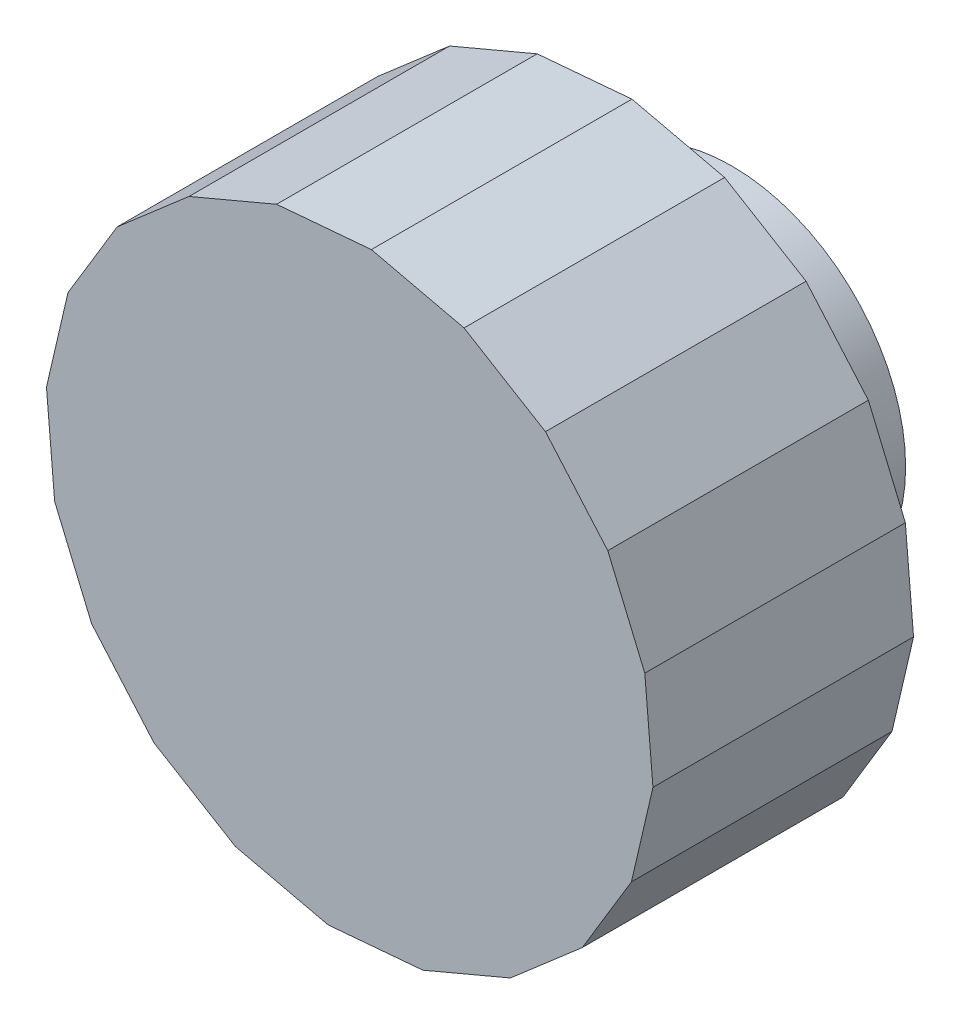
from build123d import *

# Parameters (mm, degrees)
CROQUIS1_R                 = 10
SALIENTE_EXTRUIR1_DEPTH    = 7
SALIENTE_EXTRUIR2_DEPTH    = 15
CROQUIS3_R                 = 4
CORTAR_EXTRUIR1_DEPTH      = 17
CROQUIS4_W                 = 2.75
CROQUIS4_H                 = 3
CORTAR_EXTRUIR2_DEPTH      = 6
CORTAR_EXTRUIR3_DEPTH      = 6
CORTAR_EXTRUIR3_DEPTH_BACK = 2
CROQUIS5_R                 = 1.5


with BuildPart() as part:
    # Croquis1 → Saliente-Extruir1 (new body)
    with BuildSketch(Plane.XY):
        Circle(CROQUIS1_R)
    extrude(amount=SALIENTE_EXTRUIR1_DEPTH)

    # Croquis2 → Saliente-Extruir2 (add)
    with BuildSketch(Plane.XY.offset(7)):
        Polygon((6.579765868, 16.215939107), (1.246728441, 17.455534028), (-4.208347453, 16.986459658), (-9.251480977, 14.854632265), (-13.389015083, 11.268729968), (-16.215939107, 6.579765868), (-17.455534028, 1.246728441), (-16.986459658, -4.208347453), (-14.854632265, -9.251480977), (-11.268729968, -13.389015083), (-6.579765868, -16.215939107), (-1.246728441, -17.455534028), (4.208347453, -16.986459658), (9.251480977, -14.854632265), (13.389015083, -11.268729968), (16.215939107, -6.579765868), (17.455534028, -1.246728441), (16.986459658, 4.208347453), (14.854632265, 9.251480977), (11.268729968, 13.389015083), align=None)
    extrude(amount=SALIENTE_EXTRUIR2_DEPTH)

    # Croquis3 → Cortar-Extruir1 (cut)
    with BuildSketch(Plane(origin=(0, 0, 0), x_dir=(-1, 0, 0), z_dir=(0, 0, -1))):
        Circle(CROQUIS3_R)
    extrude(amount=-CORTAR_EXTRUIR1_DEPTH, mode=Mode.SUBTRACT)

    # Croquis4 → Cortar-Extruir2 (cut)
    with BuildSketch(Plane(origin=(0, 0, 0), x_dir=(-1, 0, 0), z_dir=(0, 0, -1))):
        with Locations((1.375, 7)):
            Rectangle(CROQUIS4_W, CROQUIS4_H)
        with Locations((-1.375, 7)):
            Rectangle(CROQUIS4_W, CROQUIS4_H)
    extrude(amount=-CORTAR_EXTRUIR2_DEPTH, mode=Mode.SUBTRACT)

    # Croquis5 → Cortar-Extruir3 (cut, two sides: drawn at the far end of the back side and taken through both)
    with BuildSketch(Plane(origin=(0, 8.5, 0), x_dir=(-1, 0, 0), z_dir=(0, -1, 0)).offset(-CORTAR_EXTRUIR3_DEPTH_BACK)):
        with Locations(Location((0, -3.5, 0), (0, 0, 90))):
            Circle(CROQUIS5_R)
    extrude(amount=CORTAR_EXTRUIR3_DEPTH + CORTAR_EXTRUIR3_DEPTH_BACK, mode=Mode.SUBTRACT)


solid = part.part
